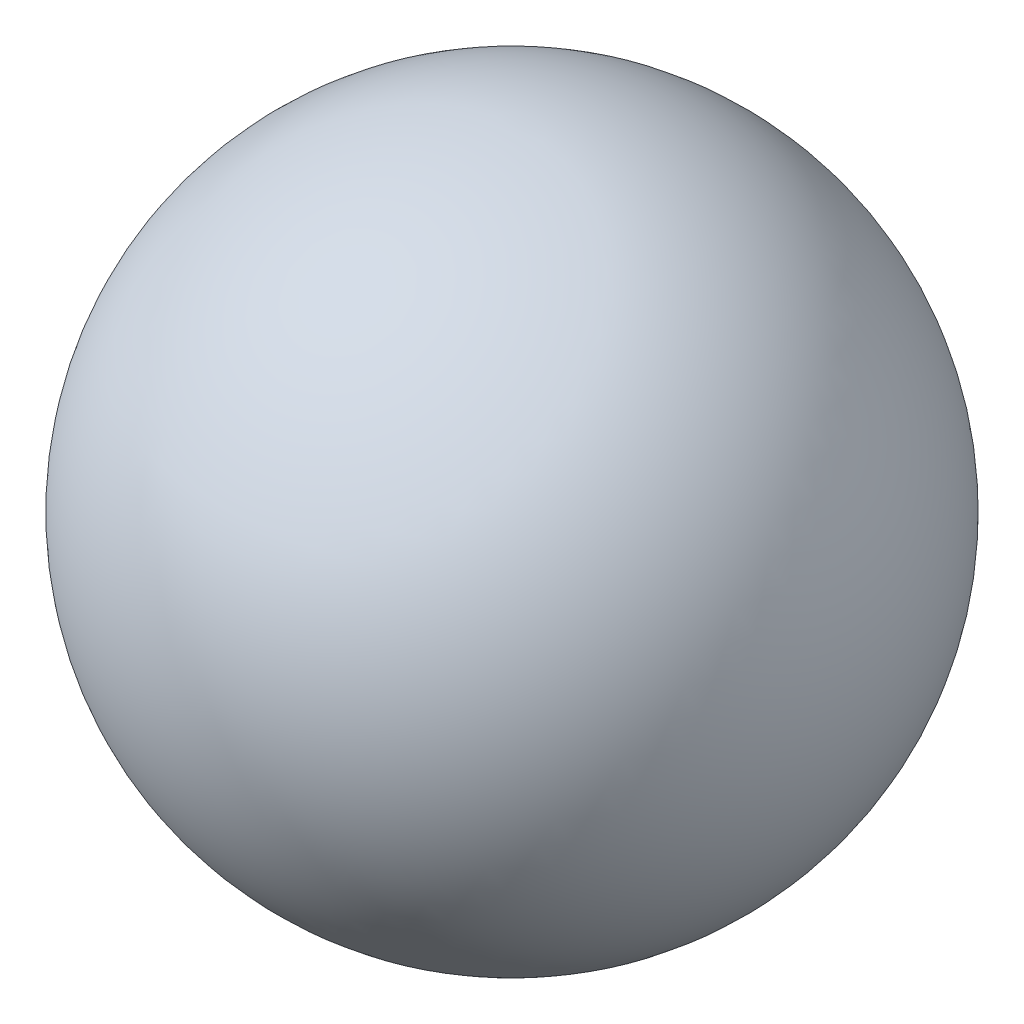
from build123d import *


with BuildPart() as part:
    # Sketch1 → Revolve7 (revolve)
    with BuildSketch(Plane.XY):
        with BuildLine():
            Line((0, 0), (0, 2.9845))
            ThreePointArc((0, 2.9845), (2.9845, 0), (0, -2.9845))
            Line((0, -2.9845), (0, -0.202274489))
            Line((0, -0.202274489), (0, 0))
        make_face()
    revolve(axis=Axis((0, 0, 0), (0, 1, 0)))


solid = part.part
